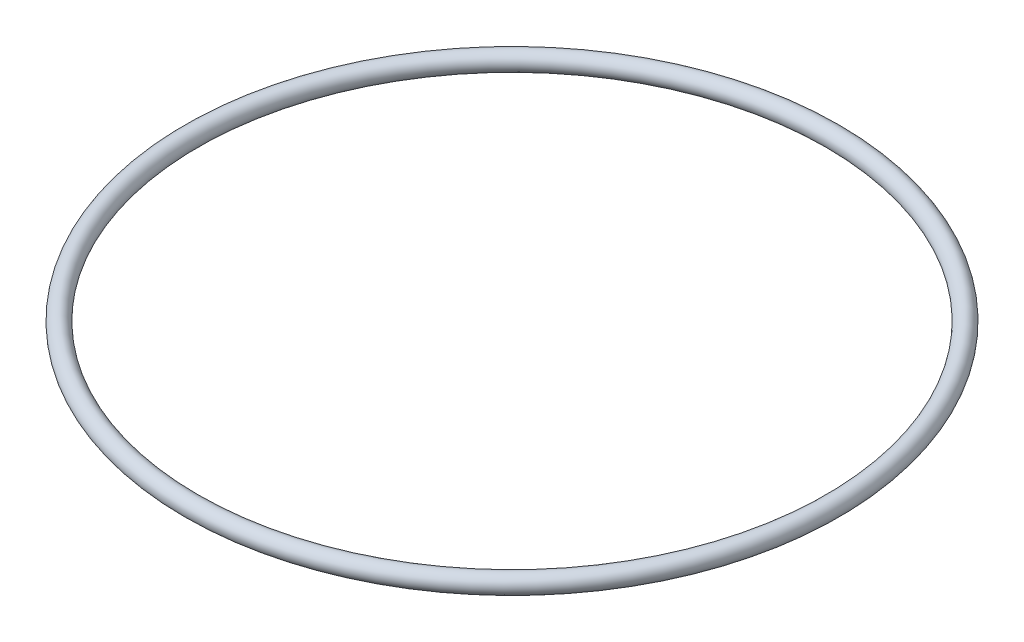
from build123d import *

# Parameters (mm, degrees)
ESQUISSE1_R = 1.5


with BuildPart() as part:
    # Esquisse1 → Base-R_volution (revolve)
    with BuildSketch(Plane.XY, mode=Mode.PRIVATE) as base_r_volution_sk:
        with Locations((52.5, 0)):
            Circle(ESQUISSE1_R)
    revolve(base_r_volution_sk.sketch.rotate(Axis((0, 1.5, 0), (0, -1, 0)), 90), axis=Axis((0, 1.5, 0), (0, -1, 0)))


solid = part.part
